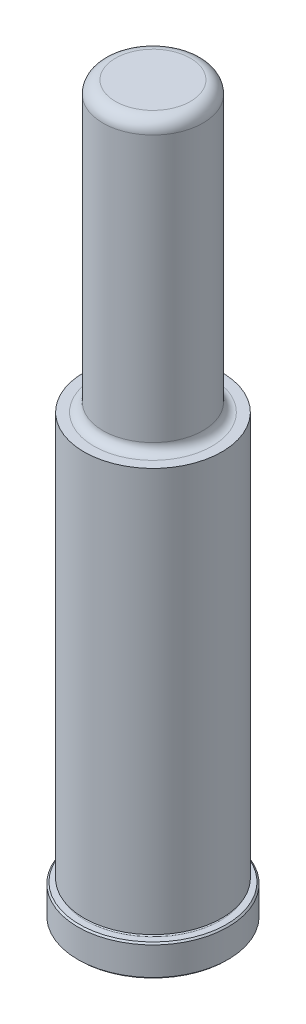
from build123d import *

# Parameters (mm, degrees)
CHAMFER1_SIZE = 0.381
FILLET7_R     = 3.175


with BuildPart() as part:
    # Sketch1 → Revolve1 (revolve)
    with BuildSketch(Plane(origin=(0, 0, 0), x_dir=(0, 0, -1), z_dir=(1, 0, 0)), mode=Mode.PRIVATE) as revolve1_sk:
        with BuildLine():
            Line((0, 0), (19.05, 0))
            Line((19.05, 0), (19.05, 7.9248))
            Line((19.05, 7.9248), (17.0688, 7.9248))
            ThreePointArc((17.0688, 7.9248), (16.6878, 8.3058), (17.0688, 8.6868))
            Line((17.0688, 8.6868), (17.4752, 8.6868))
            Line((17.4752, 8.6868), (17.4752, 111.125))
            Line((17.4752, 111.125), (14.9733, 111.125))
            ThreePointArc((14.9733, 111.125), (13.356853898, 111.794553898), (12.6873, 113.411))
            Line((12.6873, 113.411), (12.6873, 184.15))
            Line((12.6873, 184.15), (0, 184.15))
            Line((0, 184.15), (0, 0))
        make_face()
    revolve(revolve1_sk.sketch.rotate(Axis((0, 0, 0), (0, -1, 0)), 180), axis=Axis((0, 0, 0), (0, -1, 0)))

    # Chamfer1
    chamfer1_edges = [part.edges().sort_by_distance(p)[0] for p in [
        (0, 7.9248, -19.05),
        (0, 0, -19.05),
    ]]
    chamfer(chamfer1_edges, length=CHAMFER1_SIZE)

    # Fillet7
    fillet7_edges = [part.edges().sort_by_distance(p)[0] for p in [
        (0, 184.15, -12.6873),
    ]]
    fillet(fillet7_edges, radius=FILLET7_R)


solid = part.part
